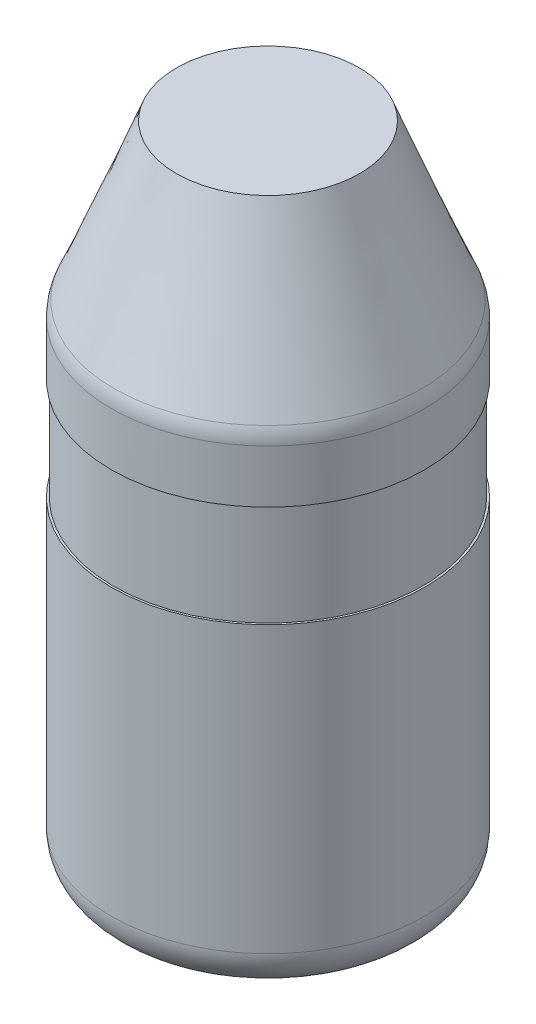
ISO-10303-21;
HEADER;
FILE_DESCRIPTION(('STEP AP214'),'2;1');
FILE_NAME('part.step','',(''),(''),'','','');
FILE_SCHEMA(('AUTOMOTIVE_DESIGN { 1 0 10303 214 1 1 1 1 }'));
ENDSEC;
DATA;
#1=APPLICATION_CONTEXT('core data for automotive mechanical design processes');
#2=APPLICATION_PROTOCOL_DEFINITION('international standard','automotive_design',2000,#1);
#3=PRODUCT_CONTEXT('',#1,'mechanical');
#4=PRODUCT('Part','Part','',(#3));
#5=PRODUCT_RELATED_PRODUCT_CATEGORY('part','',(#4));
#6=PRODUCT_DEFINITION_FORMATION('','',#4);
#7=PRODUCT_DEFINITION_CONTEXT('part definition',#1,'design');
#8=PRODUCT_DEFINITION('design','',#6,#7);
#9=PRODUCT_DEFINITION_SHAPE('','',#8);
#10=(LENGTH_UNIT() NAMED_UNIT(*) SI_UNIT(.MILLI.,.METRE.));
#11=(NAMED_UNIT(*) PLANE_ANGLE_UNIT() SI_UNIT($,.RADIAN.));
#12=(NAMED_UNIT(*) SI_UNIT($,.STERADIAN.) SOLID_ANGLE_UNIT());
#13=UNCERTAINTY_MEASURE_WITH_UNIT(LENGTH_MEASURE(1.E-05),#10,'distance_accuracy_value','');
#14=(GEOMETRIC_REPRESENTATION_CONTEXT(3) GLOBAL_UNCERTAINTY_ASSIGNED_CONTEXT((#13)) GLOBAL_UNIT_ASSIGNED_CONTEXT((#10,
#11,#12)) REPRESENTATION_CONTEXT('',''));
#15=CARTESIAN_POINT('',(0.,0.,0.));
#16=DIRECTION('',(0.,0.,1.));
#17=DIRECTION('',(1.,0.,0.));
#18=AXIS2_PLACEMENT_3D('',#15,#16,#17);
#19=CARTESIAN_POINT('',(0.,80.,0.));
#20=DIRECTION('',(0.,-1.,0.));
#21=DIRECTION('',(0.,0.,-1.));
#22=AXIS2_PLACEMENT_3D('',#19,#20,#21);
#23=CYLINDRICAL_SURFACE('',#22,38.5);
#24=CARTESIAN_POINT('',(0.,9.99999999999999,0.));
#25=DIRECTION('',(0.,1.,0.));
#26=DIRECTION('',(0.,0.,1.));
#27=AXIS2_PLACEMENT_3D('',#24,#25,#26);
#28=CIRCLE('',#27,38.5);
#29=CARTESIAN_POINT('',(0.,9.99999999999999,38.5));
#30=VERTEX_POINT('',#29);
#31=EDGE_CURVE('E61',#30,#30,#28,.T.);
#32=ORIENTED_EDGE('',*,*,#31,.T.);
#33=EDGE_LOOP('',(#32));
#34=FACE_BOUND('',#33,.T.);
#35=CARTESIAN_POINT('',(0.,80.,0.));
#36=DIRECTION('',(0.,1.,0.));
#37=DIRECTION('',(0.,0.,1.));
#38=AXIS2_PLACEMENT_3D('',#35,#36,#37);
#39=CIRCLE('',#38,38.5);
#40=CARTESIAN_POINT('',(0.,80.,38.5));
#41=VERTEX_POINT('',#40);
#42=EDGE_CURVE('E68',#41,#41,#39,.T.);
#43=ORIENTED_EDGE('',*,*,#42,.F.);
#44=EDGE_LOOP('',(#43));
#45=FACE_BOUND('',#44,.T.);
#46=ADVANCED_FACE('F43',(#34,#45),#23,.T.);
#47=CARTESIAN_POINT('',(0.,80.,0.));
#48=DIRECTION('',(0.,1.,0.));
#49=DIRECTION('',(0.,0.,1.));
#50=AXIS2_PLACEMENT_3D('',#47,#48,#49);
#51=PLANE('',#50);
#52=CARTESIAN_POINT('',(0.,80.,0.));
#53=DIRECTION('',(0.,1.,0.));
#54=DIRECTION('',(0.,0.,1.));
#55=AXIS2_PLACEMENT_3D('',#52,#53,#54);
#56=CIRCLE('',#55,38.);
#57=CARTESIAN_POINT('',(0.,80.,38.));
#58=VERTEX_POINT('',#57);
#59=EDGE_CURVE('E67',#58,#58,#56,.T.);
#60=ORIENTED_EDGE('',*,*,#59,.F.);
#61=EDGE_LOOP('',(#60));
#62=FACE_BOUND('',#61,.T.);
#63=ORIENTED_EDGE('',*,*,#42,.T.);
#64=EDGE_LOOP('',(#63));
#65=FACE_BOUND('',#64,.T.);
#66=ADVANCED_FACE('F138',(#62,#65),#51,.T.);
#67=CARTESIAN_POINT('',(0.,0.,0.));
#68=DIRECTION('',(0.,1.,0.));
#69=DIRECTION('',(0.,0.,1.));
#70=AXIS2_PLACEMENT_3D('',#67,#68,#69);
#71=PLANE('',#70);
#72=CARTESIAN_POINT('',(0.,0.,0.));
#73=DIRECTION('',(0.,1.,0.));
#74=DIRECTION('',(0.,0.,1.));
#75=AXIS2_PLACEMENT_3D('',#72,#73,#74);
#76=CIRCLE('',#75,28.5);
#77=CARTESIAN_POINT('',(0.,0.,28.5));
#78=VERTEX_POINT('',#77);
#79=EDGE_CURVE('E56',#78,#78,#76,.F.);
#80=ORIENTED_EDGE('',*,*,#79,.T.);
#81=EDGE_LOOP('',(#80));
#82=FACE_BOUND('',#81,.T.);
#83=ADVANCED_FACE('F136',(#82),#71,.F.);
#84=CARTESIAN_POINT('',(0.,105.,0.));
#85=DIRECTION('',(0.,-1.,0.));
#86=DIRECTION('',(0.,0.,-1.));
#87=AXIS2_PLACEMENT_3D('',#84,#85,#86);
#88=CYLINDRICAL_SURFACE('',#87,38.);
#89=CARTESIAN_POINT('',(0.,105.,0.));
#90=DIRECTION('',(0.,1.,0.));
#91=DIRECTION('',(0.,0.,1.));
#92=AXIS2_PLACEMENT_3D('',#89,#90,#91);
#93=CIRCLE('',#92,38.);
#94=CARTESIAN_POINT('',(0.,105.,38.));
#95=VERTEX_POINT('',#94);
#96=EDGE_CURVE('E72',#95,#95,#93,.T.);
#97=ORIENTED_EDGE('',*,*,#96,.F.);
#98=EDGE_LOOP('',(#97));
#99=FACE_BOUND('',#98,.T.);
#100=ORIENTED_EDGE('',*,*,#59,.T.);
#101=EDGE_LOOP('',(#100));
#102=FACE_BOUND('',#101,.T.);
#103=ADVANCED_FACE('F133',(#99,#102),#88,.T.);
#104=CARTESIAN_POINT('',(0.,120.,0.));
#105=DIRECTION('',(0.,-1.,0.));
#106=DIRECTION('',(0.,0.,-1.));
#107=AXIS2_PLACEMENT_3D('',#104,#105,#106);
#108=CYLINDRICAL_SURFACE('',#107,38.5);
#109=CARTESIAN_POINT('',(0.,118.00684811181,0.));
#110=DIRECTION('',(0.,-1.,0.));
#111=DIRECTION('',(0.,0.,-1.));
#112=AXIS2_PLACEMENT_3D('',#109,#110,#111);
#113=CIRCLE('',#112,38.5);
#114=CARTESIAN_POINT('',(0.,118.00684811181,-38.5));
#115=VERTEX_POINT('',#114);
#116=EDGE_CURVE('E11',#115,#115,#113,.T.);
#117=ORIENTED_EDGE('',*,*,#116,.T.);
#118=EDGE_LOOP('',(#117));
#119=FACE_BOUND('',#118,.T.);
#120=CARTESIAN_POINT('',(0.,105.,0.));
#121=DIRECTION('',(0.,1.,0.));
#122=DIRECTION('',(0.,0.,1.));
#123=AXIS2_PLACEMENT_3D('',#120,#121,#122);
#124=CIRCLE('',#123,38.5);
#125=CARTESIAN_POINT('',(0.,105.,38.5));
#126=VERTEX_POINT('',#125);
#127=EDGE_CURVE('E79',#126,#126,#124,.T.);
#128=ORIENTED_EDGE('',*,*,#127,.T.);
#129=EDGE_LOOP('',(#128));
#130=FACE_BOUND('',#129,.T.);
#131=ADVANCED_FACE('F129',(#119,#130),#108,.T.);
#132=CARTESIAN_POINT('',(0.,105.,0.));
#133=DIRECTION('',(0.,1.,0.));
#134=DIRECTION('',(0.,0.,1.));
#135=AXIS2_PLACEMENT_3D('',#132,#133,#134);
#136=PLANE('',#135);
#137=ORIENTED_EDGE('',*,*,#96,.T.);
#138=EDGE_LOOP('',(#137));
#139=FACE_BOUND('',#138,.T.);
#140=ORIENTED_EDGE('',*,*,#127,.F.);
#141=EDGE_LOOP('',(#140));
#142=FACE_BOUND('',#141,.T.);
#143=ADVANCED_FACE('F104',(#139,#142),#136,.F.);
#144=CARTESIAN_POINT('',(0.,160.,0.));
#145=DIRECTION('',(0.,1.,0.));
#146=DIRECTION('',(0.,0.,1.));
#147=AXIS2_PLACEMENT_3D('',#144,#145,#146);
#148=PLANE('',#147);
#149=CARTESIAN_POINT('',(0.,160.,0.));
#150=DIRECTION('',(0.,1.,0.));
#151=DIRECTION('',(0.,0.,1.));
#152=AXIS2_PLACEMENT_3D('',#149,#150,#151);
#153=CIRCLE('',#152,22.5);
#154=CARTESIAN_POINT('',(-11.9963614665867,160.,-19.0351598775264));
#155=VERTEX_POINT('',#154);
#156=EDGE_CURVE('E83',#155,#155,#153,.T.);
#157=ORIENTED_EDGE('',*,*,#156,.T.);
#158=EDGE_LOOP('',(#157));
#159=FACE_BOUND('',#158,.T.);
#160=ADVANCED_FACE('F94',(#159),#148,.T.);
#161=CARTESIAN_POINT('',(-27.5635545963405,120.,-26.8793686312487));
#162=CARTESIAN_POINT('',(-11.9963614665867,160.,-19.0351598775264));
#163=CARTESIAN_POINT('',(-81.3222918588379,120.,28.2477405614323));
#164=CARTESIAN_POINT('',(-50.0666812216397,160.,4.95756305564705));
#165=CARTESIAN_POINT('',(-26.1951826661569,120.,82.0064778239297));
#166=CARTESIAN_POINT('',(-26.0739582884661,160.,43.0278828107));
#167=CARTESIAN_POINT('',(27.5635545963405,120.,26.8793686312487));
#168=CARTESIAN_POINT('',(11.9963614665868,160.,19.0351598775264));
#169=CARTESIAN_POINT('',(81.3222918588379,120.,-28.2477405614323));
#170=CARTESIAN_POINT('',(50.0666812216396,160.,-4.95756305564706));
#171=CARTESIAN_POINT('',(26.1951826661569,120.,-82.0064778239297));
#172=CARTESIAN_POINT('',(26.0739582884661,160.,-43.0278828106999));
#173=CARTESIAN_POINT('',(-27.5635545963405,120.,-26.8793686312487));
#174=CARTESIAN_POINT('',(-11.9963614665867,160.,-19.0351598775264));
#175=(BOUNDED_SURFACE() B_SPLINE_SURFACE(3,1,((#161,#162),(#163,#164),(#165,#166),(#167,#168),
(#169,#170),(#171,#172),(#173,#174)),.UNSPECIFIED.,.T.,.F.,.F.) B_SPLINE_SURFACE_WITH_KNOTS((4,
3,4),(2,2),(0.,0.5,1.),(0.,1.),
.UNSPECIFIED.) GEOMETRIC_REPRESENTATION_ITEM() RATIONAL_B_SPLINE_SURFACE(((1.,1.),
(0.333333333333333,0.333333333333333),(0.333333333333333,0.333333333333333),(1.,1.),
(0.333333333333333,0.333333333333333),(0.333333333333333,0.333333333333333),(1.,1.))) REPRESENTATION_ITEM('') SURFACE());
#176=CARTESIAN_POINT('',(0.,121.837468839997,0.));
#177=DIRECTION('',(0.,1.,0.));
#178=DIRECTION('',(0.,0.,1.));
#179=AXIS2_PLACEMENT_3D('',#176,#177,#178);
#180=CIRCLE('',#179,37.7372260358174);
#181=CARTESIAN_POINT('',(-26.848448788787,121.837468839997,-26.5190314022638));
#182=VERTEX_POINT('',#181);
#183=EDGE_CURVE('E51',#182,#182,#180,.T.);
#184=CARTESIAN_POINT('',(-26.848448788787,121.837468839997,-26.5190314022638));
#185=CARTESIAN_POINT('',(-26.6937395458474,122.234995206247,-26.4410744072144));
#186=CARTESIAN_POINT('',(-26.5390303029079,122.632521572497,-26.3631174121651));
#187=CARTESIAN_POINT('',(-26.2296118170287,123.427574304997,-26.2072034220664));
#188=CARTESIAN_POINT('',(-26.0749025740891,123.825100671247,-26.1292464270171));
#189=CARTESIAN_POINT('',(-25.7654840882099,124.620153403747,-25.9733324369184));
#190=CARTESIAN_POINT('',(-25.6107748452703,125.017679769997,-25.895375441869));
#191=CARTESIAN_POINT('',(-25.3013563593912,125.812732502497,-25.7394614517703));
#192=CARTESIAN_POINT('',(-25.1466471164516,126.210258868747,-25.661504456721));
#193=CARTESIAN_POINT('',(-24.8372286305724,127.005311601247,-25.5055904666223));
#194=CARTESIAN_POINT('',(-24.6825193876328,127.402837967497,-25.4276334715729));
#195=CARTESIAN_POINT('',(-24.3731009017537,128.197890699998,-25.2717194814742));
#196=CARTESIAN_POINT('',(-24.2183916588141,128.595417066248,-25.1937624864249));
#197=CARTESIAN_POINT('',(-23.9089731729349,129.390469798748,-25.0378484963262));
#198=CARTESIAN_POINT('',(-23.7542639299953,129.787996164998,-24.9598915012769));
#199=CARTESIAN_POINT('',(-23.4448454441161,130.583048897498,-24.8039775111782));
#200=CARTESIAN_POINT('',(-23.2901362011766,130.980575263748,-24.7260205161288));
#201=CARTESIAN_POINT('',(-22.9807177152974,131.775627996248,-24.5701065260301));
#202=CARTESIAN_POINT('',(-22.8260084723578,132.173154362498,-24.4921495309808));
#203=CARTESIAN_POINT('',(-22.5165899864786,132.968207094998,-24.3362355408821));
#204=CARTESIAN_POINT('',(-22.361880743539,133.365733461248,-24.2582785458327));
#205=CARTESIAN_POINT('',(-22.0524622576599,134.160786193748,-24.102364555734));
#206=CARTESIAN_POINT('',(-21.8977530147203,134.558312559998,-24.0244075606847));
#207=CARTESIAN_POINT('',(-21.5883345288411,135.353365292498,-23.868493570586));
#208=CARTESIAN_POINT('',(-21.4336252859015,135.750891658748,-23.7905365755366));
#209=CARTESIAN_POINT('',(-21.1242068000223,136.545944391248,-23.6346225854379));
#210=CARTESIAN_POINT('',(-20.9694975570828,136.943470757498,-23.5566655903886));
#211=CARTESIAN_POINT('',(-20.6600790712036,137.738523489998,-23.4007516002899));
#212=CARTESIAN_POINT('',(-20.505369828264,138.136049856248,-23.3227946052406));
#213=CARTESIAN_POINT('',(-20.1959513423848,138.931102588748,-23.1668806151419));
#214=CARTESIAN_POINT('',(-20.0412420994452,139.328628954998,-23.0889236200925));
#215=CARTESIAN_POINT('',(-19.7318236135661,140.123681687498,-22.9330096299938));
#216=CARTESIAN_POINT('',(-19.5771143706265,140.521208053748,-22.8550526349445));
#217=CARTESIAN_POINT('',(-19.2676958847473,141.316260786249,-22.6991386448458));
#218=CARTESIAN_POINT('',(-19.1129866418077,141.713787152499,-22.6211816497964));
#219=CARTESIAN_POINT('',(-18.8035681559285,142.508839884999,-22.4652676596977));
#220=CARTESIAN_POINT('',(-18.648858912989,142.906366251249,-22.3873106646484));
#221=CARTESIAN_POINT('',(-18.3394404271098,143.701418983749,-22.2313966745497));
#222=CARTESIAN_POINT('',(-18.1847311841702,144.098945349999,-22.1534396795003));
#223=CARTESIAN_POINT('',(-17.875312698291,144.893998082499,-21.9975256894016));
#224=CARTESIAN_POINT('',(-17.7206034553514,145.291524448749,-21.9195686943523));
#225=CARTESIAN_POINT('',(-17.4111849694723,146.086577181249,-21.7636547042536));
#226=CARTESIAN_POINT('',(-17.2564757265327,146.484103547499,-21.6856977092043));
#227=CARTESIAN_POINT('',(-16.9470572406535,147.279156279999,-21.5297837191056));
#228=CARTESIAN_POINT('',(-16.7923479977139,147.676682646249,-21.4518267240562));
#229=CARTESIAN_POINT('',(-16.4829295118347,148.471735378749,-21.2959127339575));
#230=CARTESIAN_POINT('',(-16.3282202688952,148.869261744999,-21.2179557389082));
#231=CARTESIAN_POINT('',(-16.018801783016,149.664314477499,-21.0620417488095));
#232=CARTESIAN_POINT('',(-15.8640925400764,150.061840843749,-20.9840847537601));
#233=CARTESIAN_POINT('',(-15.5546740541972,150.856893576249,-20.8281707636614));
#234=CARTESIAN_POINT('',(-15.3999648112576,151.254419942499,-20.7502137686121));
#235=CARTESIAN_POINT('',(-15.0905463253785,152.049472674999,-20.5942997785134));
#236=CARTESIAN_POINT('',(-14.9358370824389,152.446999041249,-20.5163427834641));
#237=CARTESIAN_POINT('',(-14.6264185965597,153.242051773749,-20.3604287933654));
#238=CARTESIAN_POINT('',(-14.4717093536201,153.63957814,-20.282471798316));
#239=CARTESIAN_POINT('',(-14.162290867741,154.4346308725,-20.1265578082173));
#240=CARTESIAN_POINT('',(-14.0075816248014,154.83215723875,-20.048600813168));
#241=CARTESIAN_POINT('',(-13.6981631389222,155.62720997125,-19.8926868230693));
#242=CARTESIAN_POINT('',(-13.5434538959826,156.0247363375,-19.8147298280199));
#243=CARTESIAN_POINT('',(-13.2340354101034,156.81978907,-19.6588158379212));
#244=CARTESIAN_POINT('',(-13.0793261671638,157.21731543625,-19.5808588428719));
#245=CARTESIAN_POINT('',(-12.7699076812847,158.01236816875,-19.4249448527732));
#246=CARTESIAN_POINT('',(-12.6151984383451,158.409894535,-19.3469878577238));
#247=CARTESIAN_POINT('',(-12.3057799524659,159.2049472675,-19.1910738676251));
#248=CARTESIAN_POINT('',(-12.1510707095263,159.60247363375,-19.1131168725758));
#249=CARTESIAN_POINT('',(-11.9963614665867,160.,-19.0351598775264));
#250=B_SPLINE_CURVE_WITH_KNOTS('',3,(#184,#185,#186,#187,#188,#189,#190,#191,#192,#193,#194,
#195,#196,#197,#198,#199,#200,#201,#202,#203,#204,#205,#206,#207,#208,#209,#210,#211,#212,#213,
#214,#215,#216,#217,#218,#219,#220,#221,#222,#223,#224,#225,#226,#227,#228,#229,#230,#231,#232,
#233,#234,#235,#236,#237,#238,#239,#240,#241,#242,#243,#244,#245,#246,#247,#248,#249),
.UNSPECIFIED.,.F.,.F.,(4,2,2,2,2,2,2,2,2,2,2,2,2,2,2,2,2,2,2,2,2,2,2,2,2,2,2,2,2,2,2,2,4),(0.,
1.30090548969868,2.60181097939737,3.90271646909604,5.20362195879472,6.5045274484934,
7.80543293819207,9.10633842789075,10.4072439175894,11.7081494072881,13.0090548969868,
14.3099603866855,15.6108658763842,16.9117713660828,18.2126768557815,19.5135823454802,
20.8144878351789,22.1153933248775,23.4162988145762,24.7172043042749,26.0181097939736,
27.3190152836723,28.6199207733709,29.9208262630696,31.2217317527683,32.522637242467,
33.8235427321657,35.1244482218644,36.425353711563,37.7262592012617,39.0271646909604,
40.3280701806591,41.6289756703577),.UNSPECIFIED.);
#251=EDGE_CURVE('BSEAM103',#182,#155,#250,.T.);
#252=ORIENTED_EDGE('',*,*,#183,.T.);
#253=ORIENTED_EDGE('',*,*,#156,.F.);
#254=ORIENTED_EDGE('',*,*,#251,.T.);
#255=ORIENTED_EDGE('',*,*,#251,.F.);
#256=EDGE_LOOP('',(#252,#254,#253,#255));
#257=FACE_BOUND('',#256,.T.);
#258=ADVANCED_FACE('F103',(#257),#175,.T.);
#259=CARTESIAN_POINT('',(0.,9.99999999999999,0.));
#260=DIRECTION('',(0.,1.,0.));
#261=DIRECTION('',(0.,0.,1.));
#262=AXIS2_PLACEMENT_3D('',#259,#260,#261);
#263=TOROIDAL_SURFACE('',#262,28.5,10.);
#264=ORIENTED_EDGE('',*,*,#79,.F.);
#265=EDGE_LOOP('',(#264));
#266=FACE_BOUND('',#265,.T.);
#267=ORIENTED_EDGE('',*,*,#31,.F.);
#268=EDGE_LOOP('',(#267));
#269=FACE_BOUND('',#268,.T.);
#270=ADVANCED_FACE('F111',(#266,#269),#263,.T.);
#271=CARTESIAN_POINT('',(0.,118.00684811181,0.));
#272=DIRECTION('',(0.,-1.,0.));
#273=DIRECTION('',(0.,0.,-1.));
#274=AXIS2_PLACEMENT_3D('',#271,#272,#273);
#275=TOROIDAL_SURFACE('',#274,28.5,10.);
#276=ORIENTED_EDGE('',*,*,#116,.F.);
#277=EDGE_LOOP('',(#276));
#278=FACE_BOUND('',#277,.T.);
#279=ORIENTED_EDGE('',*,*,#183,.F.);
#280=EDGE_LOOP('',(#279));
#281=FACE_BOUND('',#280,.T.);
#282=ADVANCED_FACE('F45',(#278,#281),#275,.T.);
#283=CLOSED_SHELL('',(#46,#66,#83,#103,#131,#143,#160,#258,#270,#282));
#284=MANIFOLD_SOLID_BREP('B2',#283);
#285=ADVANCED_BREP_SHAPE_REPRESENTATION('',(#18,#284),#14);
#286=SHAPE_DEFINITION_REPRESENTATION(#9,#285);
ENDSEC;
END-ISO-10303-21;
